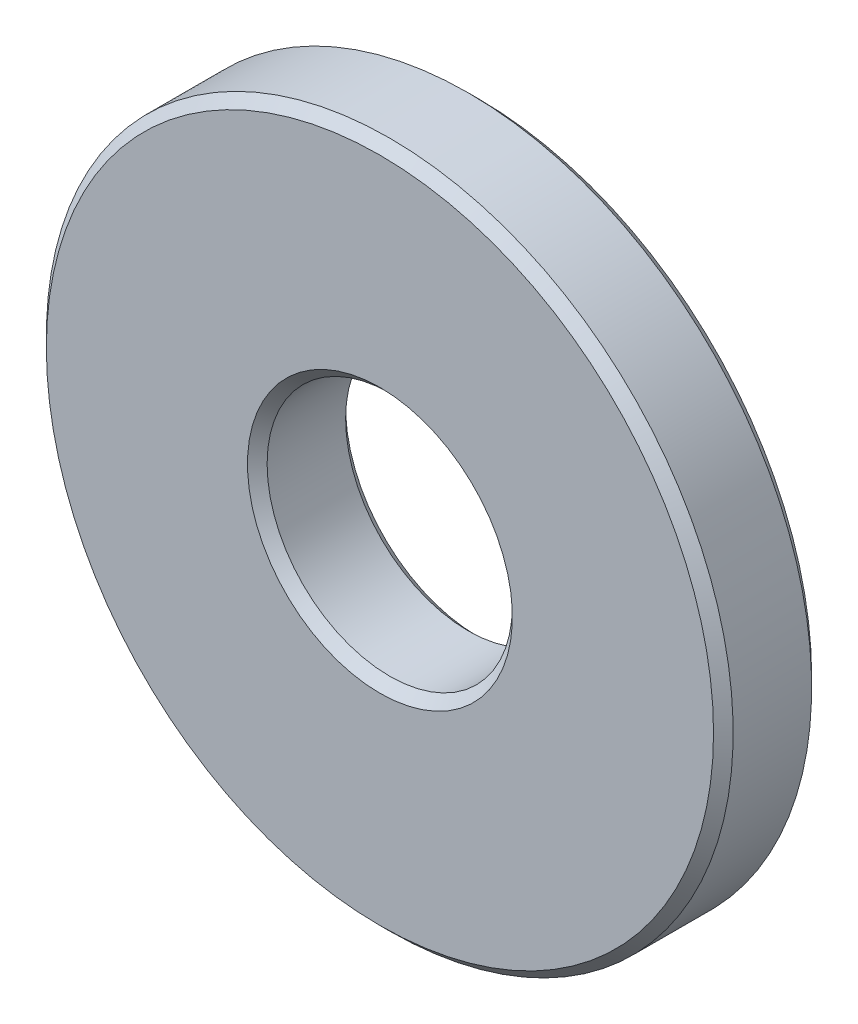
ISO-10303-21;
HEADER;
FILE_DESCRIPTION(('STEP AP214'),'2;1');
FILE_NAME('part.step','',(''),(''),'','','');
FILE_SCHEMA(('AUTOMOTIVE_DESIGN { 1 0 10303 214 1 1 1 1 }'));
ENDSEC;
DATA;
#1=APPLICATION_CONTEXT('core data for automotive mechanical design processes');
#2=APPLICATION_PROTOCOL_DEFINITION('international standard','automotive_design',2000,#1);
#3=PRODUCT_CONTEXT('',#1,'mechanical');
#4=PRODUCT('Part','Part','',(#3));
#5=PRODUCT_RELATED_PRODUCT_CATEGORY('part','',(#4));
#6=PRODUCT_DEFINITION_FORMATION('','',#4);
#7=PRODUCT_DEFINITION_CONTEXT('part definition',#1,'design');
#8=PRODUCT_DEFINITION('design','',#6,#7);
#9=PRODUCT_DEFINITION_SHAPE('','',#8);
#10=(LENGTH_UNIT() NAMED_UNIT(*) SI_UNIT(.MILLI.,.METRE.));
#11=(NAMED_UNIT(*) PLANE_ANGLE_UNIT() SI_UNIT($,.RADIAN.));
#12=(NAMED_UNIT(*) SI_UNIT($,.STERADIAN.) SOLID_ANGLE_UNIT());
#13=UNCERTAINTY_MEASURE_WITH_UNIT(LENGTH_MEASURE(1.E-05),#10,'distance_accuracy_value','');
#14=(GEOMETRIC_REPRESENTATION_CONTEXT(3) GLOBAL_UNCERTAINTY_ASSIGNED_CONTEXT((#13)) GLOBAL_UNIT_ASSIGNED_CONTEXT((#10,
#11,#12)) REPRESENTATION_CONTEXT('',''));
#15=CARTESIAN_POINT('',(0.,0.,0.));
#16=DIRECTION('',(0.,0.,1.));
#17=DIRECTION('',(1.,0.,0.));
#18=AXIS2_PLACEMENT_3D('',#15,#16,#17);
#19=CARTESIAN_POINT('',(0.,0.,0.));
#20=DIRECTION('',(0.,0.,-1.));
#21=DIRECTION('',(0.,1.,0.));
#22=AXIS2_PLACEMENT_3D('',#19,#20,#21);
#23=CYLINDRICAL_SURFACE('',#22,2.5);
#24=CARTESIAN_POINT('',(0.,0.,0.200000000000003));
#25=DIRECTION('',(0.,0.,-1.));
#26=DIRECTION('',(0.,1.,0.));
#27=AXIS2_PLACEMENT_3D('',#24,#25,#26);
#28=CIRCLE('',#27,2.5);
#29=CARTESIAN_POINT('',(0.,2.5,0.200000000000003));
#30=VERTEX_POINT('',#29);
#31=EDGE_CURVE('E38',#30,#30,#28,.T.);
#32=ORIENTED_EDGE('',*,*,#31,.T.);
#33=EDGE_LOOP('',(#32));
#34=FACE_BOUND('',#33,.T.);
#35=CARTESIAN_POINT('',(0.,0.,1.8));
#36=DIRECTION('',(0.,0.,1.));
#37=DIRECTION('',(0.,-1.,0.));
#38=AXIS2_PLACEMENT_3D('',#35,#36,#37);
#39=CIRCLE('',#38,2.5);
#40=CARTESIAN_POINT('',(0.,-2.5,1.8));
#41=VERTEX_POINT('',#40);
#42=EDGE_CURVE('E41',#41,#41,#39,.T.);
#43=ORIENTED_EDGE('',*,*,#42,.T.);
#44=EDGE_LOOP('',(#43));
#45=FACE_BOUND('',#44,.T.);
#46=ADVANCED_FACE('F12',(#34,#45),#23,.F.);
#47=CARTESIAN_POINT('',(2.5,0.,2.));
#48=DIRECTION('',(0.,0.,1.));
#49=DIRECTION('',(0.,-1.,0.));
#50=AXIS2_PLACEMENT_3D('',#47,#48,#49);
#51=PLANE('',#50);
#52=CARTESIAN_POINT('',(0.,0.,2.));
#53=DIRECTION('',(0.,0.,1.));
#54=DIRECTION('',(0.,-1.,0.));
#55=AXIS2_PLACEMENT_3D('',#52,#53,#54);
#56=CIRCLE('',#55,2.7);
#57=CARTESIAN_POINT('',(0.,-2.7,2.));
#58=VERTEX_POINT('',#57);
#59=EDGE_CURVE('E23',#58,#58,#56,.F.);
#60=ORIENTED_EDGE('',*,*,#59,.T.);
#61=EDGE_LOOP('',(#60));
#62=FACE_BOUND('',#61,.T.);
#63=CARTESIAN_POINT('',(0.,0.,2.));
#64=DIRECTION('',(0.,0.,1.));
#65=DIRECTION('',(0.,-1.,0.));
#66=AXIS2_PLACEMENT_3D('',#63,#64,#65);
#67=CIRCLE('',#66,6.8);
#68=CARTESIAN_POINT('',(0.,-6.8,2.));
#69=VERTEX_POINT('',#68);
#70=EDGE_CURVE('E27',#69,#69,#67,.T.);
#71=ORIENTED_EDGE('',*,*,#70,.T.);
#72=EDGE_LOOP('',(#71));
#73=FACE_BOUND('',#72,.T.);
#74=ADVANCED_FACE('F54',(#62,#73),#51,.T.);
#75=CARTESIAN_POINT('',(0.,0.,0.));
#76=DIRECTION('',(0.,0.,-1.));
#77=DIRECTION('',(0.,1.,0.));
#78=AXIS2_PLACEMENT_3D('',#75,#76,#77);
#79=CYLINDRICAL_SURFACE('',#78,7.);
#80=CARTESIAN_POINT('',(0.,0.,0.200000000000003));
#81=DIRECTION('',(0.,0.,-1.));
#82=DIRECTION('',(0.,1.,0.));
#83=AXIS2_PLACEMENT_3D('',#80,#81,#82);
#84=CIRCLE('',#83,7.);
#85=CARTESIAN_POINT('',(0.,7.,0.200000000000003));
#86=VERTEX_POINT('',#85);
#87=EDGE_CURVE('E8',#86,#86,#84,.F.);
#88=ORIENTED_EDGE('',*,*,#87,.T.);
#89=EDGE_LOOP('',(#88));
#90=FACE_BOUND('',#89,.T.);
#91=CARTESIAN_POINT('',(0.,0.,1.8));
#92=DIRECTION('',(0.,0.,1.));
#93=DIRECTION('',(0.,-1.,0.));
#94=AXIS2_PLACEMENT_3D('',#91,#92,#93);
#95=CIRCLE('',#94,7.);
#96=CARTESIAN_POINT('',(0.,-7.,1.8));
#97=VERTEX_POINT('',#96);
#98=EDGE_CURVE('E19',#97,#97,#95,.F.);
#99=ORIENTED_EDGE('',*,*,#98,.T.);
#100=EDGE_LOOP('',(#99));
#101=FACE_BOUND('',#100,.T.);
#102=ADVANCED_FACE('F57',(#90,#101),#79,.T.);
#103=CARTESIAN_POINT('',(2.5,0.,0.));
#104=DIRECTION('',(0.,0.,-1.));
#105=DIRECTION('',(0.,1.,0.));
#106=AXIS2_PLACEMENT_3D('',#103,#104,#105);
#107=PLANE('',#106);
#108=CARTESIAN_POINT('',(0.,0.,0.));
#109=DIRECTION('',(0.,0.,-1.));
#110=DIRECTION('',(0.,1.,0.));
#111=AXIS2_PLACEMENT_3D('',#108,#109,#110);
#112=CIRCLE('',#111,2.7);
#113=CARTESIAN_POINT('',(0.,2.7,0.));
#114=VERTEX_POINT('',#113);
#115=EDGE_CURVE('E32',#114,#114,#112,.F.);
#116=ORIENTED_EDGE('',*,*,#115,.T.);
#117=EDGE_LOOP('',(#116));
#118=FACE_BOUND('',#117,.T.);
#119=CARTESIAN_POINT('',(0.,0.,0.));
#120=DIRECTION('',(0.,0.,-1.));
#121=DIRECTION('',(0.,1.,0.));
#122=AXIS2_PLACEMENT_3D('',#119,#120,#121);
#123=CIRCLE('',#122,6.8);
#124=CARTESIAN_POINT('',(0.,6.8,0.));
#125=VERTEX_POINT('',#124);
#126=EDGE_CURVE('E35',#125,#125,#123,.T.);
#127=ORIENTED_EDGE('',*,*,#126,.T.);
#128=EDGE_LOOP('',(#127));
#129=FACE_BOUND('',#128,.T.);
#130=ADVANCED_FACE('F78',(#118,#129),#107,.T.);
#131=CARTESIAN_POINT('',(0.,0.,0.200000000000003));
#132=DIRECTION('',(0.,0.,-1.));
#133=DIRECTION('',(0.,1.,0.));
#134=AXIS2_PLACEMENT_3D('',#131,#132,#133);
#135=CONICAL_SURFACE('',#134,2.5,0.785398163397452);
#136=ORIENTED_EDGE('',*,*,#115,.F.);
#137=EDGE_LOOP('',(#136));
#138=FACE_BOUND('',#137,.T.);
#139=ORIENTED_EDGE('',*,*,#31,.F.);
#140=EDGE_LOOP('',(#139));
#141=FACE_BOUND('',#140,.T.);
#142=ADVANCED_FACE('F50',(#138,#141),#135,.F.);
#143=CARTESIAN_POINT('',(0.,0.,2.));
#144=DIRECTION('',(0.,0.,1.));
#145=DIRECTION('',(0.,-1.,0.));
#146=AXIS2_PLACEMENT_3D('',#143,#144,#145);
#147=CONICAL_SURFACE('',#146,2.7,0.785398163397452);
#148=ORIENTED_EDGE('',*,*,#42,.F.);
#149=EDGE_LOOP('',(#148));
#150=FACE_BOUND('',#149,.T.);
#151=ORIENTED_EDGE('',*,*,#59,.F.);
#152=EDGE_LOOP('',(#151));
#153=FACE_BOUND('',#152,.T.);
#154=ADVANCED_FACE('F46',(#150,#153),#147,.F.);
#155=CARTESIAN_POINT('',(0.,0.,0.));
#156=DIRECTION('',(0.,0.,1.));
#157=DIRECTION('',(0.,-1.,0.));
#158=AXIS2_PLACEMENT_3D('',#155,#156,#157);
#159=CONICAL_SURFACE('',#158,6.8,0.785398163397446);
#160=ORIENTED_EDGE('',*,*,#87,.F.);
#161=EDGE_LOOP('',(#160));
#162=FACE_BOUND('',#161,.T.);
#163=ORIENTED_EDGE('',*,*,#126,.F.);
#164=EDGE_LOOP('',(#163));
#165=FACE_BOUND('',#164,.T.);
#166=ADVANCED_FACE('F49',(#162,#165),#159,.T.);
#167=CARTESIAN_POINT('',(0.,0.,1.8));
#168=DIRECTION('',(0.,0.,-1.));
#169=DIRECTION('',(0.,1.,0.));
#170=AXIS2_PLACEMENT_3D('',#167,#168,#169);
#171=CONICAL_SURFACE('',#170,7.,0.78539816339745);
#172=ORIENTED_EDGE('',*,*,#70,.F.);
#173=EDGE_LOOP('',(#172));
#174=FACE_BOUND('',#173,.T.);
#175=ORIENTED_EDGE('',*,*,#98,.F.);
#176=EDGE_LOOP('',(#175));
#177=FACE_BOUND('',#176,.T.);
#178=ADVANCED_FACE('F14',(#174,#177),#171,.T.);
#179=CLOSED_SHELL('',(#46,#74,#102,#130,#142,#154,#166,#178));
#180=MANIFOLD_SOLID_BREP('B1',#179);
#181=ADVANCED_BREP_SHAPE_REPRESENTATION('',(#18,#180),#14);
#182=SHAPE_DEFINITION_REPRESENTATION(#9,#181);
ENDSEC;
END-ISO-10303-21;
